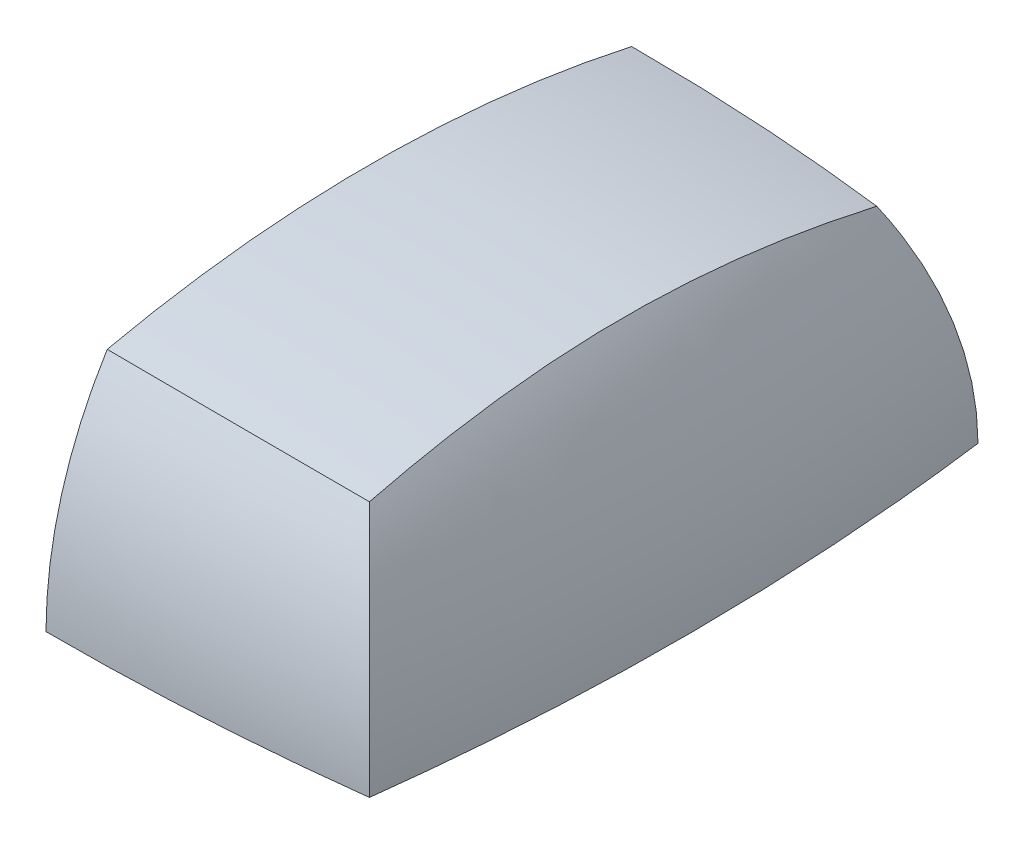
ISO-10303-21;
HEADER;
FILE_DESCRIPTION(('STEP AP214'),'2;1');
FILE_NAME('part.step','',(''),(''),'','','');
FILE_SCHEMA(('AUTOMOTIVE_DESIGN { 1 0 10303 214 1 1 1 1 }'));
ENDSEC;
DATA;
#1=APPLICATION_CONTEXT('core data for automotive mechanical design processes');
#2=APPLICATION_PROTOCOL_DEFINITION('international standard','automotive_design',2000,#1);
#3=PRODUCT_CONTEXT('',#1,'mechanical');
#4=PRODUCT('Part','Part','',(#3));
#5=PRODUCT_RELATED_PRODUCT_CATEGORY('part','',(#4));
#6=PRODUCT_DEFINITION_FORMATION('','',#4);
#7=PRODUCT_DEFINITION_CONTEXT('part definition',#1,'design');
#8=PRODUCT_DEFINITION('design','',#6,#7);
#9=PRODUCT_DEFINITION_SHAPE('','',#8);
#10=(LENGTH_UNIT() NAMED_UNIT(*) SI_UNIT(.MILLI.,.METRE.));
#11=(NAMED_UNIT(*) PLANE_ANGLE_UNIT() SI_UNIT($,.RADIAN.));
#12=(NAMED_UNIT(*) SI_UNIT($,.STERADIAN.) SOLID_ANGLE_UNIT());
#13=UNCERTAINTY_MEASURE_WITH_UNIT(LENGTH_MEASURE(1.E-05),#10,'distance_accuracy_value','');
#14=(GEOMETRIC_REPRESENTATION_CONTEXT(3) GLOBAL_UNCERTAINTY_ASSIGNED_CONTEXT((#13)) GLOBAL_UNIT_ASSIGNED_CONTEXT((#10,
#11,#12)) REPRESENTATION_CONTEXT('',''));
#15=CARTESIAN_POINT('',(0.,0.,0.));
#16=DIRECTION('',(0.,0.,1.));
#17=DIRECTION('',(1.,0.,0.));
#18=AXIS2_PLACEMENT_3D('',#15,#16,#17);
#19=CARTESIAN_POINT('',(0.,0.,-210.));
#20=DIRECTION('',(1.,0.,0.));
#21=DIRECTION('',(0.,0.,-1.));
#22=AXIS2_PLACEMENT_3D('',#19,#20,#21);
#23=PLANE('',#22);
#24=DIRECTION('',(0.,0.,1.));
#25=VECTOR('',#24,1.);
#26=CARTESIAN_POINT('',(0.,0.,-210.));
#27=LINE('',#26,#25);
#28=CARTESIAN_POINT('',(0.,0.,-200.));
#29=VERTEX_POINT('',#28);
#30=CARTESIAN_POINT('',(0.,0.,200.));
#31=VERTEX_POINT('',#30);
#32=EDGE_CURVE('E96',#29,#31,#27,.T.);
#33=ORIENTED_EDGE('',*,*,#32,.T.);
#34=CARTESIAN_POINT('',(0.,0.,-50.));
#35=DIRECTION('',(-1.,0.,0.));
#36=DIRECTION('',(0.,0.,1.));
#37=AXIS2_PLACEMENT_3D('',#34,#35,#36);
#38=CIRCLE('',#37,250.);
#39=CARTESIAN_POINT('',(0.,132.262314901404,162.147778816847));
#40=VERTEX_POINT('',#39);
#41=EDGE_CURVE('E68',#40,#31,#38,.F.);
#42=ORIENTED_EDGE('',*,*,#41,.F.);
#43=CARTESIAN_POINT('',(0.,-600.,0.));
#44=DIRECTION('',(1.,0.,0.));
#45=DIRECTION('',(0.,0.,-1.));
#46=AXIS2_PLACEMENT_3D('',#43,#44,#45);
#47=CIRCLE('',#46,750.);
#48=CARTESIAN_POINT('',(0.,132.262314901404,-162.147778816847));
#49=VERTEX_POINT('',#48);
#50=EDGE_CURVE('E156',#40,#49,#47,.F.);
#51=ORIENTED_EDGE('',*,*,#50,.T.);
#52=CARTESIAN_POINT('',(0.,0.,50.));
#53=DIRECTION('',(1.,0.,0.));
#54=DIRECTION('',(0.,0.,-1.));
#55=AXIS2_PLACEMENT_3D('',#52,#53,#54);
#56=CIRCLE('',#55,250.);
#57=EDGE_CURVE('E60',#29,#49,#56,.T.);
#58=ORIENTED_EDGE('',*,*,#57,.F.);
#59=EDGE_LOOP('',(#33,#42,#51,#58));
#60=FACE_BOUND('',#59,.T.);
#61=ADVANCED_FACE('F38',(#60),#23,.F.);
#62=CARTESIAN_POINT('',(250.000000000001,0.,-210.));
#63=DIRECTION('',(0.,1.,0.));
#64=DIRECTION('',(0.,0.,1.));
#65=AXIS2_PLACEMENT_3D('',#62,#63,#64);
#66=PLANE('',#65);
#67=CARTESIAN_POINT('',(179.999999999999,0.,250.000000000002));
#68=CARTESIAN_POINT('',(220.342149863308,0.,5.50307663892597));
#69=CARTESIAN_POINT('',(199.831126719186,0.,-239.816334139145));
#70=CARTESIAN_POINT('',(122.007407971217,0.,-471.615935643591));
#71=(BOUNDED_CURVE() B_SPLINE_CURVE(3,(#67,#68,#69,#70),.UNSPECIFIED.,.F.,
.F.) B_SPLINE_CURVE_WITH_KNOTS((4,4),(-1.94379980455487,1.),
.UNSPECIFIED.) CURVE() GEOMETRIC_REPRESENTATION_ITEM() RATIONAL_B_SPLINE_CURVE((1.,
0.993130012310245,1.00648389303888,1.04006164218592)) REPRESENTATION_ITEM(''));
#72=CARTESIAN_POINT('',(200.,0.,9.5062846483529E-13));
#73=VERTEX_POINT('',#72);
#74=CARTESIAN_POINT('',(187.309752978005,0.,-188.988898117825));
#75=VERTEX_POINT('',#74);
#76=EDGE_CURVE('E106',#73,#75,#71,.T.);
#77=ORIENTED_EDGE('',*,*,#76,.F.);
#78=CARTESIAN_POINT('',(122.007407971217,0.,-471.615935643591));
#79=CARTESIAN_POINT('',(199.831126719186,0.,-239.816334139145));
#80=CARTESIAN_POINT('',(220.342149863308,0.,5.50307663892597));
#81=CARTESIAN_POINT('',(179.999999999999,0.,250.000000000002));
#82=(BOUNDED_CURVE() B_SPLINE_CURVE(3,(#78,#79,#80,#81),.UNSPECIFIED.,.F.,
.F.) B_SPLINE_CURVE_WITH_KNOTS((4,4),(-1.94379980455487,1.),
.UNSPECIFIED.) CURVE() GEOMETRIC_REPRESENTATION_ITEM() RATIONAL_B_SPLINE_CURVE((1.04006164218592,
1.00648389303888,0.993130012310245,1.)) REPRESENTATION_ITEM(''));
#83=CARTESIAN_POINT('',(188.805768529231,0.,188.805768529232));
#84=VERTEX_POINT('',#83);
#85=EDGE_CURVE('E157',#84,#73,#82,.F.);
#86=ORIENTED_EDGE('',*,*,#85,.F.);
#87=CARTESIAN_POINT('',(5.80089734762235,0.,-1299.98878315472));
#88=DIRECTION('',(0.,1.,0.));
#89=DIRECTION('',(0.,0.,1.));
#90=AXIS2_PLACEMENT_3D('',#87,#88,#89);
#91=CIRCLE('',#90,1500.00000000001);
#92=EDGE_CURVE('E155',#31,#84,#91,.T.);
#93=ORIENTED_EDGE('',*,*,#92,.F.);
#94=ORIENTED_EDGE('',*,*,#32,.F.);
#95=CARTESIAN_POINT('',(5.80089734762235,0.,1299.98878315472));
#96=DIRECTION('',(0.,-1.,0.));
#97=DIRECTION('',(0.,0.,-1.));
#98=AXIS2_PLACEMENT_3D('',#95,#96,#97);
#99=CIRCLE('',#98,1500.00000000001);
#100=EDGE_CURVE('E152',#75,#29,#99,.F.);
#101=ORIENTED_EDGE('',*,*,#100,.F.);
#102=EDGE_LOOP('',(#77,#86,#93,#94,#101));
#103=FACE_BOUND('',#102,.T.);
#104=ADVANCED_FACE('F194',(#103),#66,.F.);
#105=CARTESIAN_POINT('',(0.,-1850.,0.));
#106=DIRECTION('',(0.,0.,-1.));
#107=DIRECTION('',(-1.,0.,0.));
#108=AXIS2_PLACEMENT_3D('',#105,#106,#107);
#109=TOROIDAL_SURFACE('',#108,1250.,750.);
#110=ORIENTED_EDGE('',*,*,#50,.F.);
#111=CARTESIAN_POINT('',(185.692383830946,125.005261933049,155.439597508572));
#112=CARTESIAN_POINT('',(180.561502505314,125.401819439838,155.843064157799));
#113=CARTESIAN_POINT('',(175.427885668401,125.782213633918,156.227574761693));
#114=CARTESIAN_POINT('',(165.155723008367,126.510628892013,156.959186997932));
#115=CARTESIAN_POINT('',(160.017177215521,126.8586501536,157.306288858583));
#116=CARTESIAN_POINT('',(149.735644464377,127.522277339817,157.963591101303));
#117=CARTESIAN_POINT('',(144.592657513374,127.837883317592,158.273791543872));
#118=CARTESIAN_POINT('',(134.306762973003,128.43640084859,158.857524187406));
#119=CARTESIAN_POINT('',(129.163858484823,128.719337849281,159.131084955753));
#120=CARTESIAN_POINT('',(118.87457393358,129.252759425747,159.642249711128));
#121=CARTESIAN_POINT('',(113.728193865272,129.503243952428,159.879853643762));
#122=CARTESIAN_POINT('',(103.432434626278,129.971717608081,160.319488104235));
#123=CARTESIAN_POINT('',(98.2830554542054,130.189706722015,160.52151861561));
#124=CARTESIAN_POINT('',(87.9653641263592,130.593791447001,160.890934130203));
#125=CARTESIAN_POINT('',(82.7970438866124,130.779783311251,161.05820678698));
#126=CARTESIAN_POINT('',(72.4583127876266,131.118986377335,161.357592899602));
#127=CARTESIAN_POINT('',(67.2879019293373,131.272197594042,161.489706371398));
#128=CARTESIAN_POINT('',(56.9454370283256,131.545806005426,161.719024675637));
#129=CARTESIAN_POINT('',(51.7733829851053,131.666203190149,161.816229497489));
#130=CARTESIAN_POINT('',(41.4240002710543,131.874236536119,161.97599301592));
#131=CARTESIAN_POINT('',(36.2466706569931,131.961846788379,162.038524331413));
#132=CARTESIAN_POINT('',(25.8912595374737,132.104147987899,162.128975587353));
#133=CARTESIAN_POINT('',(20.7131780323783,132.158838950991,162.156895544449));
#134=CARTESIAN_POINT('',(10.3567100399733,132.23528393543,162.178209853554));
#135=CARTESIAN_POINT('',(5.17832355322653,132.257038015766,162.171604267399));
#136=CARTESIAN_POINT('',(0.,132.262314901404,162.147778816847));
#137=B_SPLINE_CURVE_WITH_KNOTS('',3,(#111,#112,#113,#114,#115,#116,#117,#118,#119,#120,#121,
#122,#123,#124,#125,#126,#127,#128,#129,#130,#131,#132,#133,#134,#135,#136),.UNSPECIFIED.,.F.,
.F.,(4,2,2,2,2,2,2,2,2,2,2,2,4),(0.,15.485857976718,30.9716214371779,46.4573595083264,
61.9309524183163,77.4045687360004,92.878192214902,108.401078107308,123.923956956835,
139.446840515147,154.981964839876,170.517081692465,186.052170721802),.UNSPECIFIED.);
#138=CARTESIAN_POINT('',(157.4677012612,127.021822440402,157.467701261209));
#139=VERTEX_POINT('',#138);
#140=EDGE_CURVE('E95',#139,#40,#137,.T.);
#141=ORIENTED_EDGE('',*,*,#140,.F.);
#142=CARTESIAN_POINT('',(156.571356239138,120.021244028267,-187.310190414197));
#143=CARTESIAN_POINT('',(156.542133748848,120.728309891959,-184.586372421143));
#144=CARTESIAN_POINT('',(156.509824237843,121.420228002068,-181.858656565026));
#145=CARTESIAN_POINT('',(156.439917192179,122.773621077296,-176.395754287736));
#146=CARTESIAN_POINT('',(156.402319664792,123.43509608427,-173.660567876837));
#147=CARTESIAN_POINT('',(156.322722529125,124.727457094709,-168.183042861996));
#148=CARTESIAN_POINT('',(156.280722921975,125.358343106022,-165.440704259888));
#149=CARTESIAN_POINT('',(156.193171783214,126.589640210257,-159.948058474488));
#150=CARTESIAN_POINT('',(156.147618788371,127.190038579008,-157.197748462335));
#151=CARTESIAN_POINT('',(156.053829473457,128.359943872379,-151.690609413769));
#152=CARTESIAN_POINT('',(156.005593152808,128.929450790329,-148.933780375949));
#153=CARTESIAN_POINT('',(155.907270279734,130.037439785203,-143.413933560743));
#154=CARTESIAN_POINT('',(155.857183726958,130.575921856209,-140.650915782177));
#155=CARTESIAN_POINT('',(155.730650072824,131.883401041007,-133.734903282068));
#156=CARTESIAN_POINT('',(155.653553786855,132.632912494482,-129.578221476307));
#157=CARTESIAN_POINT('',(155.499661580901,134.061395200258,-121.252749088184));
#158=CARTESIAN_POINT('',(155.422865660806,134.7403664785,-117.083958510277));
#159=CARTESIAN_POINT('',(155.297177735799,135.812942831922,-110.12644315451));
#160=CARTESIAN_POINT('',(155.247514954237,136.226245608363,-107.340754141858));
#161=CARTESIAN_POINT('',(155.150111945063,137.021216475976,-101.764825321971));
#162=CARTESIAN_POINT('',(155.102371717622,137.402884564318,-98.9745855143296));
#163=CARTESIAN_POINT('',(155.009468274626,138.134484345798,-93.3899059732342));
#164=CARTESIAN_POINT('',(154.964305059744,138.484416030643,-90.5954662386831));
#165=CARTESIAN_POINT('',(154.877165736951,139.152463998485,-85.002611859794));
#166=CARTESIAN_POINT('',(154.835189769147,139.470578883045,-82.2041970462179));
#167=CARTESIAN_POINT('',(154.754995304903,140.074888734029,-76.6038674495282));
#168=CARTESIAN_POINT('',(154.716776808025,140.361083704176,-73.8019526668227));
#169=CARTESIAN_POINT('',(154.644616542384,140.901473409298,-68.1949922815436));
#170=CARTESIAN_POINT('',(154.610674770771,141.155668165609,-65.3899466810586));
#171=CARTESIAN_POINT('',(154.532764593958,141.74347205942,-58.4633331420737));
#172=CARTESIAN_POINT('',(154.491540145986,142.058555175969,-54.3401470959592));
#173=CARTESIAN_POINT('',(154.420612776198,142.619396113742,-46.0889799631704));
#174=CARTESIAN_POINT('',(154.390909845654,142.865153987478,-41.9609988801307));
#175=CARTESIAN_POINT('',(154.344040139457,143.287159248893,-33.7020434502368));
#176=CARTESIAN_POINT('',(154.326871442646,143.463417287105,-29.5710696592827));
#177=CARTESIAN_POINT('',(154.305797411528,143.746363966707,-21.3067045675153));
#178=CARTESIAN_POINT('',(154.301892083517,143.853052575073,-17.1733132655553));
#179=CARTESIAN_POINT('',(154.307789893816,143.99677861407,-8.90614991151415));
#180=CARTESIAN_POINT('',(154.317590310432,144.0338298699,-4.77237809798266));
#181=CARTESIAN_POINT('',(154.351045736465,144.038301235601,3.49514181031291));
#182=CARTESIAN_POINT('',(154.374700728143,144.005721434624,7.62888990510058));
#183=CARTESIAN_POINT('',(154.435712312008,143.870970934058,15.8941723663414));
#184=CARTESIAN_POINT('',(154.473065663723,143.768816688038,20.0257070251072));
#185=CARTESIAN_POINT('',(154.561035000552,143.495003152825,28.2863498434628));
#186=CARTESIAN_POINT('',(154.611651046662,143.323343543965,32.4154579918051));
#187=CARTESIAN_POINT('',(154.725401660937,142.910690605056,40.6688852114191));
#188=CARTESIAN_POINT('',(154.788532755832,142.669716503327,44.7932052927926));
#189=CARTESIAN_POINT('',(154.926317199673,142.118575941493,53.0369609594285));
#190=CARTESIAN_POINT('',(155.000970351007,141.808410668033,57.1563966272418));
#191=CARTESIAN_POINT('',(155.148987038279,141.168941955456,64.7938073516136));
#192=CARTESIAN_POINT('',(155.220975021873,140.848897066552,68.312587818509));
#193=CARTESIAN_POINT('',(155.371503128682,140.158506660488,75.3447247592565));
#194=CARTESIAN_POINT('',(155.450042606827,139.788166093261,78.8580817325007));
#195=CARTESIAN_POINT('',(155.61261363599,138.997352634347,85.878759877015));
#196=CARTESIAN_POINT('',(155.69664478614,138.576883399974,89.3860814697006));
#197=CARTESIAN_POINT('',(155.86902486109,137.685993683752,96.3940894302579));
#198=CARTESIAN_POINT('',(155.957373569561,137.215575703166,99.8947761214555));
#199=CARTESIAN_POINT('',(156.137110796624,136.224982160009,106.888917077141));
#200=CARTESIAN_POINT('',(156.228499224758,135.704808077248,110.382371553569));
#201=CARTESIAN_POINT('',(156.41294367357,134.614907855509,117.361454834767));
#202=CARTESIAN_POINT('',(156.50599967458,134.045182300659,120.84708373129));
#203=CARTESIAN_POINT('',(156.693364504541,132.849749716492,127.848852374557));
#204=CARTESIAN_POINT('',(156.787675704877,132.223487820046,131.364897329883));
#205=CARTESIAN_POINT('',(156.97493045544,130.920754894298,138.387771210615));
#206=CARTESIAN_POINT('',(157.067873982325,130.244283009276,141.894599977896));
#207=CARTESIAN_POINT('',(157.250741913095,128.841375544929,148.898436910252));
#208=CARTESIAN_POINT('',(157.340666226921,128.114938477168,152.395444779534));
#209=CARTESIAN_POINT('',(157.515785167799,126.612355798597,159.379038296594));
#210=CARTESIAN_POINT('',(157.600979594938,125.836208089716,162.865623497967));
#211=CARTESIAN_POINT('',(157.764881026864,124.234467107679,169.827773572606));
#212=CARTESIAN_POINT('',(157.843587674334,123.408871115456,173.303337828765));
#213=CARTESIAN_POINT('',(157.992705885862,121.708507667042,180.242849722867));
#214=CARTESIAN_POINT('',(158.06311687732,120.83373682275,183.706796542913));
#215=CARTESIAN_POINT('',(158.128473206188,119.934553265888,187.164493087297));
#216=B_SPLINE_CURVE_WITH_KNOTS('',3,(#142,#143,#144,#145,#146,#147,#148,#149,#150,#151,#152,
#153,#154,#155,#156,#157,#158,#159,#160,#161,#162,#163,#164,#165,#166,#167,#168,#169,#170,#171,
#172,#173,#174,#175,#176,#177,#178,#179,#180,#181,#182,#183,#184,#185,#186,#187,#188,#189,#190,
#191,#192,#193,#194,#195,#196,#197,#198,#199,#200,#201,#202,#203,#204,#205,#206,#207,#208,#209,
#210,#211,#212,#213,#214,#215),.UNSPECIFIED.,.F.,.F.,(4,2,2,2,2,2,2,2,2,2,2,2,2,2,2,2,2,2,2,2,2,
2,2,2,2,2,2,2,2,2,2,2,2,2,2,2,4),(0.,8.44269121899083,16.8853708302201,25.3280482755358,
33.774220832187,42.2203952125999,50.666571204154,63.3391969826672,76.0118181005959,
84.461511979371,92.9112066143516,101.360903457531,109.81097152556,118.261038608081,
126.711100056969,139.116706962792,151.522304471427,163.926000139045,176.329701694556,
188.730940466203,201.132163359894,213.530454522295,225.928802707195,238.323714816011,
250.718414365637,261.320171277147,271.920885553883,282.52082689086,293.120237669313,
303.719333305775,314.318304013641,325.035821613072,335.753521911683,346.471541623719,
357.190013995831,367.909076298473,378.628878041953),.UNSPECIFIED.);
#217=CARTESIAN_POINT('',(156.15309815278,127.107723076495,-157.552938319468));
#218=VERTEX_POINT('',#217);
#219=EDGE_CURVE('E99',#218,#139,#216,.T.);
#220=ORIENTED_EDGE('',*,*,#219,.F.);
#221=CARTESIAN_POINT('',(0.,132.262314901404,-162.147778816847));
#222=CARTESIAN_POINT('',(5.12080011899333,132.257096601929,-162.17133991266));
#223=CARTESIAN_POINT('',(10.2416617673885,132.235765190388,-162.178061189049));
#224=CARTESIAN_POINT('',(20.4830905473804,132.160893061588,-162.15774191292));
#225=CARTESIAN_POINT('',(25.6036576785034,132.107352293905,-162.130701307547));
#226=CARTESIAN_POINT('',(35.8440657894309,131.968078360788,-162.042775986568));
#227=CARTESIAN_POINT('',(40.9639067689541,131.882345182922,-161.981891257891));
#228=CARTESIAN_POINT('',(51.1984774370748,131.678788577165,-161.826191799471));
#229=CARTESIAN_POINT('',(56.3132080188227,131.56098999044,-161.731403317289));
#230=CARTESIAN_POINT('',(66.5410821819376,131.293301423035,-161.507697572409));
#231=CARTESIAN_POINT('',(71.6542257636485,131.143411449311,-161.378780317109));
#232=CARTESIAN_POINT('',(81.8784936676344,130.811572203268,-161.086577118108));
#233=CARTESIAN_POINT('',(86.9896179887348,130.629622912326,-160.923291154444));
#234=CARTESIAN_POINT('',(97.2251706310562,130.233090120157,-160.561507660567));
#235=CARTESIAN_POINT('',(102.349591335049,130.018407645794,-160.362903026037));
#236=CARTESIAN_POINT('',(112.595496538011,129.556860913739,-159.930492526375));
#237=CARTESIAN_POINT('',(117.716981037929,129.309996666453,-159.696686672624));
#238=CARTESIAN_POINT('',(127.956544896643,128.784128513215,-159.193498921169));
#239=CARTESIAN_POINT('',(133.074624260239,128.50512465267,-158.924117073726));
#240=CARTESIAN_POINT('',(143.310872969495,127.914791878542,-158.349138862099));
#241=CARTESIAN_POINT('',(148.429039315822,127.603438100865,-158.043514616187));
#242=CARTESIAN_POINT('',(158.661016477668,126.948628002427,-157.39576609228));
#243=CARTESIAN_POINT('',(163.774827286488,126.605171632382,-157.05364175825));
#244=CARTESIAN_POINT('',(173.997613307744,125.886198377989,-156.332396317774));
#245=CARTESIAN_POINT('',(179.106588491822,125.510681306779,-155.953274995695));
#246=CARTESIAN_POINT('',(184.212879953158,125.119156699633,-155.555408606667));
#247=B_SPLINE_CURVE_WITH_KNOTS('',3,(#221,#222,#223,#224,#225,#226,#227,#228,#229,#230,#231,
#232,#233,#234,#235,#236,#237,#238,#239,#240,#241,#242,#243,#244,#245,#246),.UNSPECIFIED.,.F.,
.F.,(4,2,2,2,2,2,2,2,2,2,2,2,4),(0.,15.362518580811,30.7250612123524,46.0876097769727,
61.4382906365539,76.7889681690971,92.1396546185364,107.537711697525,122.93576379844,
138.333794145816,153.743748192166,169.153725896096,184.563793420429),.UNSPECIFIED.);
#248=EDGE_CURVE('E89',#49,#218,#247,.T.);
#249=ORIENTED_EDGE('',*,*,#248,.F.);
#250=EDGE_LOOP('',(#110,#141,#220,#249));
#251=FACE_BOUND('',#250,.T.);
#252=ADVANCED_FACE('F100',(#251),#109,.T.);
#253=CARTESIAN_POINT('',(0.,0.,-200.));
#254=CARTESIAN_POINT('',(83.7945019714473,0.,-200.324057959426));
#255=CARTESIAN_POINT('',(167.322766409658,0.,-193.64179680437));
#256=CARTESIAN_POINT('',(250.000000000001,0.,-180.));
#257=CARTESIAN_POINT('',(0.,56.7928121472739,-200.));
#258=CARTESIAN_POINT('',(83.7945019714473,56.7928121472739,-200.324057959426));
#259=CARTESIAN_POINT('',(167.322766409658,56.7928121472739,-193.64179680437));
#260=CARTESIAN_POINT('',(250.000000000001,56.7928121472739,-180.));
#261=CARTESIAN_POINT('',(0.,110.440256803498,-181.36199599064));
#262=CARTESIAN_POINT('',(82.7533193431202,110.440256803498,-181.686053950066));
#263=CARTESIAN_POINT('',(165.244045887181,110.440256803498,-175.090835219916));
#264=CARTESIAN_POINT('',(246.894650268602,110.440256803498,-161.622513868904));
#265=CARTESIAN_POINT('',(0.,155.,-146.15045245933));
#266=CARTESIAN_POINT('',(80.7862821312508,155.,-146.474510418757));
#267=CARTESIAN_POINT('',(161.316857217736,155.,-140.043735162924));
#268=CARTESIAN_POINT('',(241.027919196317,155.,-126.903149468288));
#269=(BOUNDED_SURFACE() B_SPLINE_SURFACE(3,3,((#253,#254,#255,#256),(#257,#258,#259,#260),(#261,
#262,#263,#264),(#265,#266,#267,#268)),.UNSPECIFIED.,.F.,.F.,
.F.) B_SPLINE_SURFACE_WITH_KNOTS((4,4),(4,4),(0.,1.),(0.,1.),
.UNSPECIFIED.) GEOMETRIC_REPRESENTATION_ITEM() RATIONAL_B_SPLINE_SURFACE(((1.,0.997666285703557,
0.997666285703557,1.),(0.963077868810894,0.960830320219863,0.960830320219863,0.963077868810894),
(0.963077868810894,0.960830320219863,0.960830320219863,0.963077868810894),(1.,0.997666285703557,
0.997666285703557,1.))) REPRESENTATION_ITEM('') SURFACE());
#270=CARTESIAN_POINT('',(187.309752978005,0.,-188.988898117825));
#271=CARTESIAN_POINT('',(187.309761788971,1.79161772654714,-188.988907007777));
#272=CARTESIAN_POINT('',(187.29259672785,3.58323397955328,-188.971588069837));
#273=CARTESIAN_POINT('',(187.223989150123,7.16477823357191,-188.902365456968));
#274=CARTESIAN_POINT('',(187.172553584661,8.95470650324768,-188.850468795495));
#275=CARTESIAN_POINT('',(187.035484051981,12.5316871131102,-188.71217049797));
#276=CARTESIAN_POINT('',(186.949854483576,14.3187397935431,-188.625773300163));
#277=CARTESIAN_POINT('',(186.744527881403,17.8887858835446,-188.418606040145));
#278=CARTESIAN_POINT('',(186.624832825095,19.6717795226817,-188.297837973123));
#279=CARTESIAN_POINT('',(186.351755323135,23.2297398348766,-188.022312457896));
#280=CARTESIAN_POINT('',(186.198425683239,25.0047146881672,-187.867608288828));
#281=CARTESIAN_POINT('',(185.858177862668,28.548258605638,-187.52431030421));
#282=CARTESIAN_POINT('',(185.671257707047,30.3168272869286,-187.335714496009));
#283=CARTESIAN_POINT('',(185.264071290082,33.846404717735,-186.924877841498));
#284=CARTESIAN_POINT('',(185.043801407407,35.6074126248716,-186.702633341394));
#285=CARTESIAN_POINT('',(184.570206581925,39.1206773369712,-186.224792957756));
#286=CARTESIAN_POINT('',(184.3168766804,40.872932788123,-185.969192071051));
#287=CARTESIAN_POINT('',(183.608229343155,45.4640540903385,-185.254192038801));
#288=CARTESIAN_POINT('',(183.125935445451,48.2946099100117,-184.76757459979));
#289=CARTESIAN_POINT('',(182.076302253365,53.9244343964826,-183.708531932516));
#290=CARTESIAN_POINT('',(181.508940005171,56.7236943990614,-183.136083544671));
#291=CARTESIAN_POINT('',(180.291116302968,62.2860251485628,-181.907342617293));
#292=CARTESIAN_POINT('',(179.640640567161,65.0490895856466,-181.251035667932));
#293=CARTESIAN_POINT('',(178.258853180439,70.5341287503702,-179.856861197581));
#294=CARTESIAN_POINT('',(177.527540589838,73.2561029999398,-179.118992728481));
#295=CARTESIAN_POINT('',(175.984346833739,78.6622739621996,-177.561964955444));
#296=CARTESIAN_POINT('',(175.172249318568,81.3463459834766,-176.742587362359));
#297=CARTESIAN_POINT('',(173.471819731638,86.6649858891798,-175.026914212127));
#298=CARTESIAN_POINT('',(172.583494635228,89.2995582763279,-174.130625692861));
#299=CARTESIAN_POINT('',(170.733312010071,94.5158123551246,-172.263857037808));
#300=CARTESIAN_POINT('',(169.771459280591,97.0974974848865,-171.293381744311));
#301=CARTESIAN_POINT('',(167.777070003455,102.204781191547,-169.281113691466));
#302=CARTESIAN_POINT('',(166.744542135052,104.730386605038,-168.239329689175));
#303=CARTESIAN_POINT('',(164.929609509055,108.978644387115,-166.408127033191));
#304=CARTESIAN_POINT('',(164.16441212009,110.716193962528,-165.636070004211));
#305=CARTESIAN_POINT('',(162.601629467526,114.161489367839,-164.059277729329));
#306=CARTESIAN_POINT('',(161.804046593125,115.869237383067,-163.254544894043));
#307=CARTESIAN_POINT('',(160.177465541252,119.25425195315,-161.613382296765));
#308=CARTESIAN_POINT('',(159.348467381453,120.931518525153,-160.776952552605));
#309=CARTESIAN_POINT('',(157.66003328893,124.254948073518,-159.073382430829));
#310=CARTESIAN_POINT('',(156.800596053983,125.901109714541,-158.206240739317));
#311=CARTESIAN_POINT('',(155.052285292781,129.161718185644,-156.442257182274));
#312=CARTESIAN_POINT('',(154.163410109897,130.776163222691,-155.545413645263));
#313=CARTESIAN_POINT('',(152.361635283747,133.964983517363,-153.727486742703));
#314=CARTESIAN_POINT('',(151.448872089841,135.539514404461,-152.80654104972));
#315=CARTESIAN_POINT('',(149.596239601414,138.656029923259,-150.937300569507));
#316=CARTESIAN_POINT('',(148.656370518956,140.198014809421,-149.989005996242));
#317=CARTESIAN_POINT('',(146.750575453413,143.248917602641,-148.066126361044));
#318=CARTESIAN_POINT('',(145.784651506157,144.757838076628,-147.091543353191));
#319=CARTESIAN_POINT('',(143.827819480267,147.742116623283,-145.117169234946));
#320=CARTESIAN_POINT('',(142.836915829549,149.217480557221,-144.117382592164));
#321=CARTESIAN_POINT('',(140.831216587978,152.134195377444,-142.093703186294));
#322=CARTESIAN_POINT('',(139.816428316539,153.575556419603,-141.069817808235));
#323=CARTESIAN_POINT('',(138.790025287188,155.,-140.03421355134));
#324=B_SPLINE_CURVE_WITH_KNOTS('',3,(#270,#271,#272,#273,#274,#275,#276,#277,#278,#279,#280,
#281,#282,#283,#284,#285,#286,#287,#288,#289,#290,#291,#292,#293,#294,#295,#296,#297,#298,#299,
#300,#301,#302,#303,#304,#305,#306,#307,#308,#309,#310,#311,#312,#313,#314,#315,#316,#317,#318,
#319,#320,#321,#322,#323),.UNSPECIFIED.,.F.,.F.,(4,2,2,2,2,2,2,2,2,2,2,2,2,2,2,2,2,2,2,2,2,2,2,
2,2,2,4),(0.,5.37468491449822,10.7482800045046,16.1211840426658,21.4937762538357,
26.857993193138,32.2225256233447,37.5876409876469,42.953561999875,51.687546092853,
60.4238911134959,69.1617393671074,77.8996892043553,86.6617045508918,95.422918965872,
104.183562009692,112.943131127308,119.091115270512,125.238646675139,131.386174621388,
137.53396588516,143.682103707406,149.800607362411,155.919063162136,162.037042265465,
168.153944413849,174.268995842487),.UNSPECIFIED.);
#325=EDGE_CURVE('E53',#75,#218,#324,.T.);
#326=ORIENTED_EDGE('',*,*,#57,.T.);
#327=ORIENTED_EDGE('',*,*,#248,.T.);
#328=ORIENTED_EDGE('',*,*,#325,.F.);
#329=ORIENTED_EDGE('',*,*,#100,.T.);
#330=EDGE_LOOP('',(#326,#327,#328,#329));
#331=FACE_BOUND('',#330,.T.);
#332=ADVANCED_FACE('F91',(#331),#269,.T.);
#333=CARTESIAN_POINT('',(0.,0.,200.));
#334=CARTESIAN_POINT('',(83.7945019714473,0.,200.324057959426));
#335=CARTESIAN_POINT('',(167.322766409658,0.,193.64179680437));
#336=CARTESIAN_POINT('',(250.000000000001,0.,180.));
#337=CARTESIAN_POINT('',(0.,56.7928121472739,200.));
#338=CARTESIAN_POINT('',(83.7945019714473,56.7928121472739,200.324057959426));
#339=CARTESIAN_POINT('',(167.322766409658,56.7928121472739,193.64179680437));
#340=CARTESIAN_POINT('',(250.000000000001,56.7928121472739,180.));
#341=CARTESIAN_POINT('',(0.,110.440256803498,181.36199599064));
#342=CARTESIAN_POINT('',(82.7533193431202,110.440256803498,181.686053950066));
#343=CARTESIAN_POINT('',(165.244045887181,110.440256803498,175.090835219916));
#344=CARTESIAN_POINT('',(246.894650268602,110.440256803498,161.622513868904));
#345=CARTESIAN_POINT('',(0.,155.,146.15045245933));
#346=CARTESIAN_POINT('',(80.7862821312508,155.,146.474510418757));
#347=CARTESIAN_POINT('',(161.316857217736,155.,140.043735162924));
#348=CARTESIAN_POINT('',(241.027919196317,155.,126.903149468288));
#349=(BOUNDED_SURFACE() B_SPLINE_SURFACE(3,3,((#333,#334,#335,#336),(#337,#338,#339,#340),(#341,
#342,#343,#344),(#345,#346,#347,#348)),.UNSPECIFIED.,.F.,.F.,
.F.) B_SPLINE_SURFACE_WITH_KNOTS((4,4),(4,4),(0.,1.),(0.,1.),
.UNSPECIFIED.) GEOMETRIC_REPRESENTATION_ITEM() RATIONAL_B_SPLINE_SURFACE(((1.,0.997666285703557,
0.997666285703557,1.),(0.963077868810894,0.960830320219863,0.960830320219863,0.963077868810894),
(0.963077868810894,0.960830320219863,0.960830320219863,0.963077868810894),(1.,0.997666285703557,
0.997666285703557,1.))) REPRESENTATION_ITEM('') SURFACE());
#350=CARTESIAN_POINT('',(139.928608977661,155.,139.928608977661));
#351=CARTESIAN_POINT('',(141.397153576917,152.97723071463,141.397153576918));
#352=CARTESIAN_POINT('',(142.842173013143,150.920184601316,142.842173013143));
#353=CARTESIAN_POINT('',(145.684392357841,146.735453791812,145.684392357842));
#354=CARTESIAN_POINT('',(147.081521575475,144.607673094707,147.081521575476));
#355=CARTESIAN_POINT('',(149.824254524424,140.283168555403,149.824254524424));
#356=CARTESIAN_POINT('',(151.169810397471,138.086383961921,151.169810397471));
#357=CARTESIAN_POINT('',(153.805828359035,133.625822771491,153.805828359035));
#358=CARTESIAN_POINT('',(155.096263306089,131.362014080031,155.096263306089));
#359=CARTESIAN_POINT('',(157.618627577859,126.769528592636,157.618627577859));
#360=CARTESIAN_POINT('',(158.850547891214,124.440841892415,158.850547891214));
#361=CARTESIAN_POINT('',(161.251212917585,119.723677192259,161.251212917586));
#362=CARTESIAN_POINT('',(162.420035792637,117.33527879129,162.420035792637));
#363=CARTESIAN_POINT('',(164.692893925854,112.498681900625,164.692893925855));
#364=CARTESIAN_POINT('',(165.796949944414,110.050502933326,165.796949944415));
#365=CARTESIAN_POINT('',(167.93732571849,105.097012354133,167.93732571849));
#366=CARTESIAN_POINT('',(168.973673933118,102.59172535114,168.973673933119));
#367=CARTESIAN_POINT('',(170.975842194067,97.5268338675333,170.975842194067));
#368=CARTESIAN_POINT('',(171.941693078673,94.9672537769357,171.941693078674));
#369=CARTESIAN_POINT('',(173.800243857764,89.7966678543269,173.800243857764));
#370=CARTESIAN_POINT('',(174.692971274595,87.1856818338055,174.692971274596));
#371=CARTESIAN_POINT('',(176.246939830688,82.3957485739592,176.246939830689));
#372=CARTESIAN_POINT('',(176.920696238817,80.2249030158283,176.920696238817));
#373=CARTESIAN_POINT('',(178.216318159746,75.852734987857,178.216318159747));
#374=CARTESIAN_POINT('',(178.838189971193,73.6514162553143,178.838189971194));
#375=CARTESIAN_POINT('',(180.028767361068,69.2202958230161,180.028767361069));
#376=CARTESIAN_POINT('',(180.597474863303,66.9904951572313,180.597474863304));
#377=CARTESIAN_POINT('',(181.679586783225,62.5083767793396,181.679586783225));
#378=CARTESIAN_POINT('',(182.193082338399,60.256103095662,182.193082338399));
#379=CARTESIAN_POINT('',(183.164716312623,55.7277076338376,183.164716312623));
#380=CARTESIAN_POINT('',(183.622852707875,53.451584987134,183.622852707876));
#381=CARTESIAN_POINT('',(184.482699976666,48.878034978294,184.482699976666));
#382=CARTESIAN_POINT('',(184.884409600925,46.5806071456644,184.884409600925));
#383=CARTESIAN_POINT('',(185.550261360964,42.4630156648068,185.550261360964));
#384=CARTESIAN_POINT('',(185.825414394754,40.646396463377,185.825414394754));
#385=CARTESIAN_POINT('',(186.33995033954,37.0030141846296,186.339950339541));
#386=CARTESIAN_POINT('',(186.579332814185,35.1762509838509,186.579332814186));
#387=CARTESIAN_POINT('',(187.02196059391,31.5139950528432,187.021960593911));
#388=CARTESIAN_POINT('',(187.225205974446,29.6785023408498,187.225205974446));
#389=CARTESIAN_POINT('',(187.595252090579,26.0001925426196,187.59525209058));
#390=CARTESIAN_POINT('',(187.762053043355,24.1573755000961,187.762053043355));
#391=CARTESIAN_POINT('',(188.059399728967,20.4603225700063,188.059399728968));
#392=CARTESIAN_POINT('',(188.189835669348,18.6060690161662,188.189835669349));
#393=CARTESIAN_POINT('',(188.413588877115,14.8930721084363,188.413588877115));
#394=CARTESIAN_POINT('',(188.506905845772,13.034328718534,188.506905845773));
#395=CARTESIAN_POINT('',(188.656273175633,9.31379110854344,188.656273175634));
#396=CARTESIAN_POINT('',(188.712322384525,7.45199679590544,188.712322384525));
#397=CARTESIAN_POINT('',(188.787076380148,3.72680230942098,188.787076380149));
#398=CARTESIAN_POINT('',(188.805779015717,1.86340204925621,188.805779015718));
#399=CARTESIAN_POINT('',(188.805768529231,0.,188.805768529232));
#400=B_SPLINE_CURVE_WITH_KNOTS('',3,(#350,#351,#352,#353,#354,#355,#356,#357,#358,#359,#360,
#361,#362,#363,#364,#365,#366,#367,#368,#369,#370,#371,#372,#373,#374,#375,#376,#377,#378,#379,
#380,#381,#382,#383,#384,#385,#386,#387,#388,#389,#390,#391,#392,#393,#394,#395,#396,#397,#398,
#399),.UNSPECIFIED.,.F.,.F.,(4,2,2,2,2,2,2,2,2,2,2,2,2,2,2,2,2,2,2,2,2,2,2,2,4),(0.,
8.6970607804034,17.4064501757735,26.1237350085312,34.8452638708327,43.5681315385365,
52.27993336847,60.9889272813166,69.6942367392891,78.3957150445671,87.0939030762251,
94.2048954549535,101.315023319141,108.424893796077,115.522841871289,122.621049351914,
129.719413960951,135.29221918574,140.865092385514,146.437953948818,152.010782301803,
157.600258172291,163.189779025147,168.779472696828,174.36948832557),.UNSPECIFIED.);
#401=EDGE_CURVE('E11',#139,#84,#400,.T.);
#402=ORIENTED_EDGE('',*,*,#401,.F.);
#403=ORIENTED_EDGE('',*,*,#140,.T.);
#404=ORIENTED_EDGE('',*,*,#41,.T.);
#405=ORIENTED_EDGE('',*,*,#92,.T.);
#406=EDGE_LOOP('',(#402,#403,#404,#405));
#407=FACE_BOUND('',#406,.T.);
#408=ADVANCED_FACE('F126',(#407),#349,.F.);
#409=CARTESIAN_POINT('',(122.007407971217,0.,-471.615935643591));
#410=CARTESIAN_POINT('',(199.831126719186,0.,-239.816334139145));
#411=CARTESIAN_POINT('',(220.342149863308,0.,5.50307663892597));
#412=CARTESIAN_POINT('',(179.999999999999,0.,250.000000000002));
#413=CARTESIAN_POINT('',(122.007407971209,56.7928121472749,-471.615935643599));
#414=CARTESIAN_POINT('',(199.831126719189,56.7928121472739,-239.816334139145));
#415=CARTESIAN_POINT('',(220.342149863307,56.7928121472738,5.50307663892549));
#416=CARTESIAN_POINT('',(179.999999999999,56.7928121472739,250.000000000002));
#417=CARTESIAN_POINT('',(104.315818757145,110.440256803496,-465.752245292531));
#418=CARTESIAN_POINT('',(181.183697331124,110.440256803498,-236.836549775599));
#419=CARTESIAN_POINT('',(201.451654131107,110.440256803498,5.43372209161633));
#420=CARTESIAN_POINT('',(161.622513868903,110.440256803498,246.894650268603));
#421=CARTESIAN_POINT('',(70.8922738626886,155.,-454.674364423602));
#422=CARTESIAN_POINT('',(145.954347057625,155.,-231.207041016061));
#423=CARTESIAN_POINT('',(165.763094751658,155.,5.30269515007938));
#424=CARTESIAN_POINT('',(126.903149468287,155.,241.027919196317));
#425=(BOUNDED_SURFACE() B_SPLINE_SURFACE(3,3,((#409,#410,#411,#412),(#413,#414,#415,#416),(#417,
#418,#419,#420),(#421,#422,#423,#424)),.UNSPECIFIED.,.F.,.F.,
.F.) B_SPLINE_SURFACE_WITH_KNOTS((4,4),(4,4),(0.,1.),(-1.94379980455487,1.),
.UNSPECIFIED.) GEOMETRIC_REPRESENTATION_ITEM() RATIONAL_B_SPLINE_SURFACE(((1.04006164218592,
1.00648389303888,0.993130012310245,1.),(1.00166034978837,0.969322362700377,0.956461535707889,
0.963077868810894),(1.00166034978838,0.969322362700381,0.956461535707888,0.963077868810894),
(1.04006164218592,1.00648389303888,0.993130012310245,1.))) REPRESENTATION_ITEM('') SURFACE());
#426=ORIENTED_EDGE('',*,*,#325,.T.);
#427=ORIENTED_EDGE('',*,*,#219,.T.);
#428=ORIENTED_EDGE('',*,*,#401,.T.);
#429=ORIENTED_EDGE('',*,*,#85,.T.);
#430=ORIENTED_EDGE('',*,*,#76,.T.);
#431=EDGE_LOOP('',(#426,#427,#428,#429,#430));
#432=FACE_BOUND('',#431,.T.);
#433=ADVANCED_FACE('F40',(#432),#425,.T.);
#434=CLOSED_SHELL('',(#61,#104,#252,#332,#408,#433));
#435=MANIFOLD_SOLID_BREP('B2',#434);
#436=ADVANCED_BREP_SHAPE_REPRESENTATION('',(#18,#435),#14);
#437=SHAPE_DEFINITION_REPRESENTATION(#9,#436);
ENDSEC;
END-ISO-10303-21;
